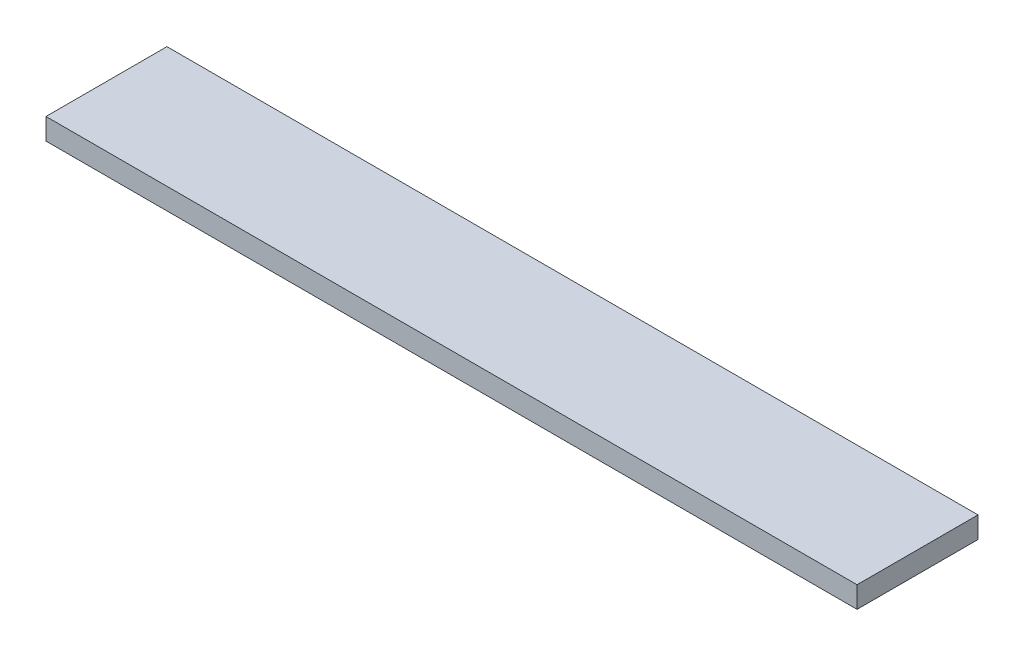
ISO-10303-21;
HEADER;
FILE_DESCRIPTION(('STEP AP214'),'2;1');
FILE_NAME('part.step','',(''),(''),'','','');
FILE_SCHEMA(('AUTOMOTIVE_DESIGN { 1 0 10303 214 1 1 1 1 }'));
ENDSEC;
DATA;
#1=APPLICATION_CONTEXT('core data for automotive mechanical design processes');
#2=APPLICATION_PROTOCOL_DEFINITION('international standard','automotive_design',2000,#1);
#3=PRODUCT_CONTEXT('',#1,'mechanical');
#4=PRODUCT('Part','Part','',(#3));
#5=PRODUCT_RELATED_PRODUCT_CATEGORY('part','',(#4));
#6=PRODUCT_DEFINITION_FORMATION('','',#4);
#7=PRODUCT_DEFINITION_CONTEXT('part definition',#1,'design');
#8=PRODUCT_DEFINITION('design','',#6,#7);
#9=PRODUCT_DEFINITION_SHAPE('','',#8);
#10=(LENGTH_UNIT() NAMED_UNIT(*) SI_UNIT(.MILLI.,.METRE.));
#11=(NAMED_UNIT(*) PLANE_ANGLE_UNIT() SI_UNIT($,.RADIAN.));
#12=(NAMED_UNIT(*) SI_UNIT($,.STERADIAN.) SOLID_ANGLE_UNIT());
#13=UNCERTAINTY_MEASURE_WITH_UNIT(LENGTH_MEASURE(1.E-05),#10,'distance_accuracy_value','');
#14=(GEOMETRIC_REPRESENTATION_CONTEXT(3) GLOBAL_UNCERTAINTY_ASSIGNED_CONTEXT((#13)) GLOBAL_UNIT_ASSIGNED_CONTEXT((#10,
#11,#12)) REPRESENTATION_CONTEXT('',''));
#15=CARTESIAN_POINT('',(0.,0.,0.));
#16=DIRECTION('',(0.,0.,1.));
#17=DIRECTION('',(1.,0.,0.));
#18=AXIS2_PLACEMENT_3D('',#15,#16,#17);
#19=CARTESIAN_POINT('',(285.,15.,-42.5));
#20=DIRECTION('',(-1.,0.,0.));
#21=DIRECTION('',(0.,0.,1.));
#22=AXIS2_PLACEMENT_3D('',#19,#20,#21);
#23=PLANE('',#22);
#24=DIRECTION('',(0.,0.,-1.));
#25=VECTOR('',#24,1.);
#26=CARTESIAN_POINT('',(285.,0.,-42.5));
#27=LINE('',#26,#25);
#28=CARTESIAN_POINT('',(285.,0.,42.5));
#29=VERTEX_POINT('',#28);
#30=CARTESIAN_POINT('',(285.,0.,-42.5));
#31=VERTEX_POINT('',#30);
#32=EDGE_CURVE('E111',#29,#31,#27,.T.);
#33=ORIENTED_EDGE('',*,*,#32,.T.);
#34=DIRECTION('',(0.,-1.,0.));
#35=VECTOR('',#34,1.);
#36=CARTESIAN_POINT('',(285.,15.,-42.5));
#37=LINE('',#36,#35);
#38=CARTESIAN_POINT('',(285.,15.,-42.5));
#39=VERTEX_POINT('',#38);
#40=EDGE_CURVE('E11',#39,#31,#37,.T.);
#41=ORIENTED_EDGE('',*,*,#40,.F.);
#42=DIRECTION('',(0.,0.,-1.));
#43=VECTOR('',#42,1.);
#44=CARTESIAN_POINT('',(285.,15.,-42.5));
#45=LINE('',#44,#43);
#46=CARTESIAN_POINT('',(285.,15.,42.5));
#47=VERTEX_POINT('',#46);
#48=EDGE_CURVE('E95',#47,#39,#45,.T.);
#49=ORIENTED_EDGE('',*,*,#48,.F.);
#50=DIRECTION('',(0.,-1.,0.));
#51=VECTOR('',#50,1.);
#52=CARTESIAN_POINT('',(285.,15.,42.5));
#53=LINE('',#52,#51);
#54=EDGE_CURVE('E107',#47,#29,#53,.T.);
#55=ORIENTED_EDGE('',*,*,#54,.T.);
#56=EDGE_LOOP('',(#33,#41,#49,#55));
#57=FACE_BOUND('',#56,.T.);
#58=ADVANCED_FACE('F43',(#57),#23,.F.);
#59=CARTESIAN_POINT('',(-285.,15.,-42.5));
#60=DIRECTION('',(0.,0.,1.));
#61=DIRECTION('',(1.,0.,0.));
#62=AXIS2_PLACEMENT_3D('',#59,#60,#61);
#63=PLANE('',#62);
#64=DIRECTION('',(-1.,0.,0.));
#65=VECTOR('',#64,1.);
#66=CARTESIAN_POINT('',(-285.,0.,-42.5));
#67=LINE('',#66,#65);
#68=CARTESIAN_POINT('',(-285.,0.,-42.5));
#69=VERTEX_POINT('',#68);
#70=EDGE_CURVE('E100',#31,#69,#67,.T.);
#71=ORIENTED_EDGE('',*,*,#70,.T.);
#72=DIRECTION('',(0.,-1.,0.));
#73=VECTOR('',#72,1.);
#74=CARTESIAN_POINT('',(-285.,15.,-42.5));
#75=LINE('',#74,#73);
#76=CARTESIAN_POINT('',(-285.,15.,-42.5));
#77=VERTEX_POINT('',#76);
#78=EDGE_CURVE('E52',#77,#69,#75,.T.);
#79=ORIENTED_EDGE('',*,*,#78,.F.);
#80=DIRECTION('',(-1.,0.,0.));
#81=VECTOR('',#80,1.);
#82=CARTESIAN_POINT('',(-285.,15.,-42.5));
#83=LINE('',#82,#81);
#84=EDGE_CURVE('E90',#39,#77,#83,.T.);
#85=ORIENTED_EDGE('',*,*,#84,.F.);
#86=ORIENTED_EDGE('',*,*,#40,.T.);
#87=EDGE_LOOP('',(#71,#79,#85,#86));
#88=FACE_BOUND('',#87,.T.);
#89=ADVANCED_FACE('F99',(#88),#63,.F.);
#90=CARTESIAN_POINT('',(-285.,15.,-42.5));
#91=DIRECTION('',(1.,0.,0.));
#92=DIRECTION('',(0.,0.,-1.));
#93=AXIS2_PLACEMENT_3D('',#90,#91,#92);
#94=PLANE('',#93);
#95=DIRECTION('',(0.,0.,1.));
#96=VECTOR('',#95,1.);
#97=CARTESIAN_POINT('',(-285.,0.,-42.5));
#98=LINE('',#97,#96);
#99=CARTESIAN_POINT('',(-285.,0.,42.5));
#100=VERTEX_POINT('',#99);
#101=EDGE_CURVE('E77',#69,#100,#98,.T.);
#102=ORIENTED_EDGE('',*,*,#101,.T.);
#103=DIRECTION('',(0.,-1.,0.));
#104=VECTOR('',#103,1.);
#105=CARTESIAN_POINT('',(-285.,15.,42.5));
#106=LINE('',#105,#104);
#107=CARTESIAN_POINT('',(-285.,15.,42.5));
#108=VERTEX_POINT('',#107);
#109=EDGE_CURVE('E102',#108,#100,#106,.T.);
#110=ORIENTED_EDGE('',*,*,#109,.F.);
#111=DIRECTION('',(0.,0.,1.));
#112=VECTOR('',#111,1.);
#113=CARTESIAN_POINT('',(-285.,15.,-42.5));
#114=LINE('',#113,#112);
#115=EDGE_CURVE('E93',#77,#108,#114,.T.);
#116=ORIENTED_EDGE('',*,*,#115,.F.);
#117=ORIENTED_EDGE('',*,*,#78,.T.);
#118=EDGE_LOOP('',(#102,#110,#116,#117));
#119=FACE_BOUND('',#118,.T.);
#120=ADVANCED_FACE('F103',(#119),#94,.F.);
#121=CARTESIAN_POINT('',(-285.,15.,42.5));
#122=DIRECTION('',(0.,0.,-1.));
#123=DIRECTION('',(-1.,0.,0.));
#124=AXIS2_PLACEMENT_3D('',#121,#122,#123);
#125=PLANE('',#124);
#126=DIRECTION('',(1.,0.,0.));
#127=VECTOR('',#126,1.);
#128=CARTESIAN_POINT('',(-285.,0.,42.5));
#129=LINE('',#128,#127);
#130=EDGE_CURVE('E83',#100,#29,#129,.T.);
#131=ORIENTED_EDGE('',*,*,#130,.T.);
#132=ORIENTED_EDGE('',*,*,#54,.F.);
#133=DIRECTION('',(1.,0.,0.));
#134=VECTOR('',#133,1.);
#135=CARTESIAN_POINT('',(-285.,15.,42.5));
#136=LINE('',#135,#134);
#137=EDGE_CURVE('E60',#108,#47,#136,.T.);
#138=ORIENTED_EDGE('',*,*,#137,.F.);
#139=ORIENTED_EDGE('',*,*,#109,.T.);
#140=EDGE_LOOP('',(#131,#132,#138,#139));
#141=FACE_BOUND('',#140,.T.);
#142=ADVANCED_FACE('F124',(#141),#125,.F.);
#143=CARTESIAN_POINT('',(0.,15.,0.));
#144=DIRECTION('',(0.,1.,0.));
#145=DIRECTION('',(0.,0.,1.));
#146=AXIS2_PLACEMENT_3D('',#143,#144,#145);
#147=PLANE('',#146);
#148=ORIENTED_EDGE('',*,*,#48,.T.);
#149=ORIENTED_EDGE('',*,*,#84,.T.);
#150=ORIENTED_EDGE('',*,*,#115,.T.);
#151=ORIENTED_EDGE('',*,*,#137,.T.);
#152=EDGE_LOOP('',(#148,#149,#150,#151));
#153=FACE_BOUND('',#152,.T.);
#154=ADVANCED_FACE('F91',(#153),#147,.T.);
#155=CARTESIAN_POINT('',(0.,0.,0.));
#156=DIRECTION('',(0.,1.,0.));
#157=DIRECTION('',(0.,0.,1.));
#158=AXIS2_PLACEMENT_3D('',#155,#156,#157);
#159=PLANE('',#158);
#160=ORIENTED_EDGE('',*,*,#32,.F.);
#161=ORIENTED_EDGE('',*,*,#130,.F.);
#162=ORIENTED_EDGE('',*,*,#101,.F.);
#163=ORIENTED_EDGE('',*,*,#70,.F.);
#164=EDGE_LOOP('',(#160,#161,#162,#163));
#165=FACE_BOUND('',#164,.T.);
#166=ADVANCED_FACE('F127',(#165),#159,.F.);
#167=CLOSED_SHELL('',(#58,#89,#120,#142,#154,#166));
#168=MANIFOLD_SOLID_BREP('B2',#167);
#169=ADVANCED_BREP_SHAPE_REPRESENTATION('',(#18,#168),#14);
#170=SHAPE_DEFINITION_REPRESENTATION(#9,#169);
ENDSEC;
END-ISO-10303-21;
